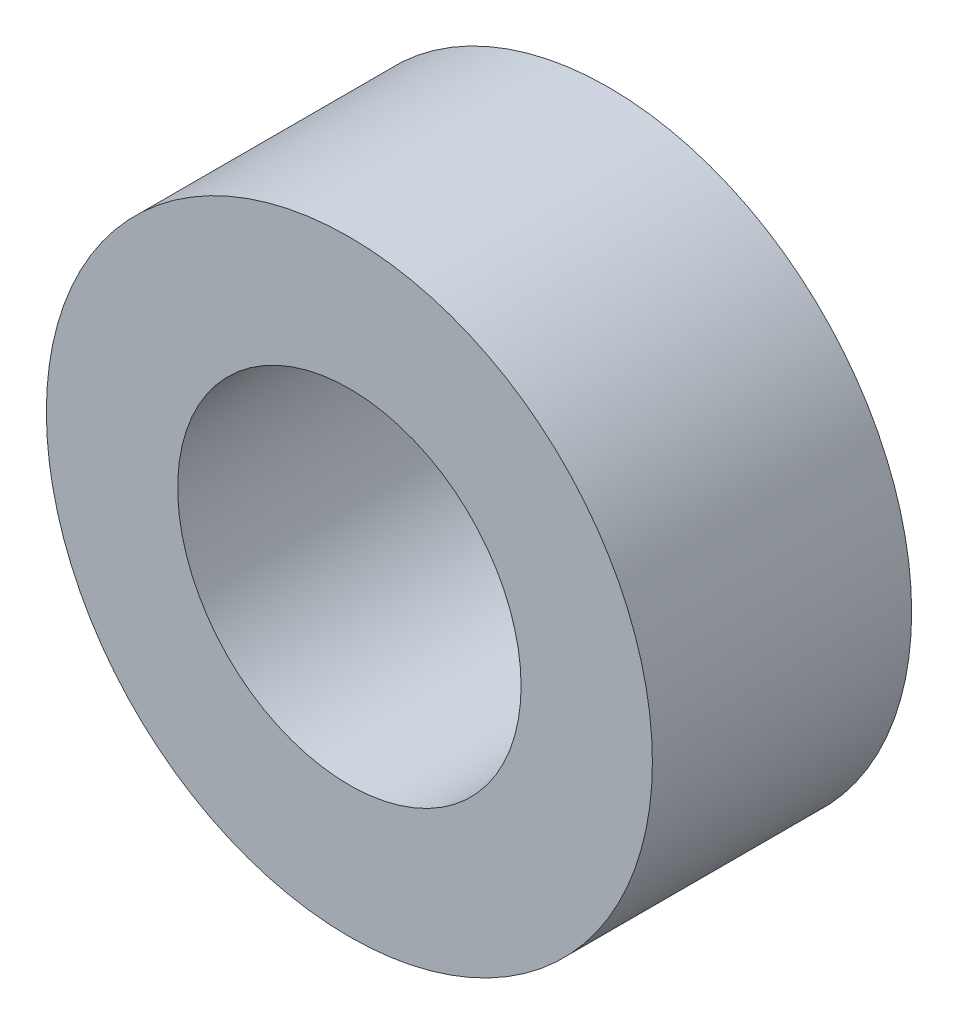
ISO-10303-21;
HEADER;
FILE_DESCRIPTION(('STEP AP214'),'2;1');
FILE_NAME('part.step','',(''),(''),'','','');
FILE_SCHEMA(('AUTOMOTIVE_DESIGN { 1 0 10303 214 1 1 1 1 }'));
ENDSEC;
DATA;
#1=APPLICATION_CONTEXT('core data for automotive mechanical design processes');
#2=APPLICATION_PROTOCOL_DEFINITION('international standard','automotive_design',2000,#1);
#3=PRODUCT_CONTEXT('',#1,'mechanical');
#4=PRODUCT('Part','Part','',(#3));
#5=PRODUCT_RELATED_PRODUCT_CATEGORY('part','',(#4));
#6=PRODUCT_DEFINITION_FORMATION('','',#4);
#7=PRODUCT_DEFINITION_CONTEXT('part definition',#1,'design');
#8=PRODUCT_DEFINITION('design','',#6,#7);
#9=PRODUCT_DEFINITION_SHAPE('','',#8);
#10=(LENGTH_UNIT() NAMED_UNIT(*) SI_UNIT(.MILLI.,.METRE.));
#11=(NAMED_UNIT(*) PLANE_ANGLE_UNIT() SI_UNIT($,.RADIAN.));
#12=(NAMED_UNIT(*) SI_UNIT($,.STERADIAN.) SOLID_ANGLE_UNIT());
#13=UNCERTAINTY_MEASURE_WITH_UNIT(LENGTH_MEASURE(1.E-05),#10,'distance_accuracy_value','');
#14=(GEOMETRIC_REPRESENTATION_CONTEXT(3) GLOBAL_UNCERTAINTY_ASSIGNED_CONTEXT((#13)) GLOBAL_UNIT_ASSIGNED_CONTEXT((#10,
#11,#12)) REPRESENTATION_CONTEXT('',''));
#15=CARTESIAN_POINT('',(0.,0.,0.));
#16=DIRECTION('',(0.,0.,1.));
#17=DIRECTION('',(1.,0.,0.));
#18=AXIS2_PLACEMENT_3D('',#15,#16,#17);
#19=CARTESIAN_POINT('',(0.,0.,77.));
#20=DIRECTION('',(0.,0.,1.));
#21=DIRECTION('',(1.,0.,0.));
#22=AXIS2_PLACEMENT_3D('',#19,#20,#21);
#23=PLANE('',#22);
#24=CARTESIAN_POINT('',(0.,0.,77.));
#25=DIRECTION('',(0.,0.,1.));
#26=DIRECTION('',(1.,0.,0.));
#27=AXIS2_PLACEMENT_3D('',#24,#25,#26);
#28=CIRCLE('',#27,90.);
#29=CARTESIAN_POINT('',(90.,0.,77.));
#30=VERTEX_POINT('',#29);
#31=EDGE_CURVE('E10',#30,#30,#28,.T.);
#32=ORIENTED_EDGE('',*,*,#31,.T.);
#33=EDGE_LOOP('',(#32));
#34=FACE_BOUND('',#33,.T.);
#35=CARTESIAN_POINT('',(0.,0.,77.));
#36=DIRECTION('',(0.,0.,1.));
#37=DIRECTION('',(1.,0.,0.));
#38=AXIS2_PLACEMENT_3D('',#35,#36,#37);
#39=CIRCLE('',#38,51.);
#40=CARTESIAN_POINT('',(51.,0.,77.));
#41=VERTEX_POINT('',#40);
#42=EDGE_CURVE('E42',#41,#41,#39,.T.);
#43=ORIENTED_EDGE('',*,*,#42,.F.);
#44=EDGE_LOOP('',(#43));
#45=FACE_BOUND('',#44,.T.);
#46=ADVANCED_FACE('F31',(#34,#45),#23,.T.);
#47=CARTESIAN_POINT('',(0.,0.,0.));
#48=DIRECTION('',(0.,0.,1.));
#49=DIRECTION('',(1.,0.,0.));
#50=AXIS2_PLACEMENT_3D('',#47,#48,#49);
#51=PLANE('',#50);
#52=CARTESIAN_POINT('',(0.,0.,0.));
#53=DIRECTION('',(0.,0.,1.));
#54=DIRECTION('',(1.,0.,0.));
#55=AXIS2_PLACEMENT_3D('',#52,#53,#54);
#56=CIRCLE('',#55,90.);
#57=CARTESIAN_POINT('',(90.,0.,0.));
#58=VERTEX_POINT('',#57);
#59=EDGE_CURVE('E35',#58,#58,#56,.T.);
#60=ORIENTED_EDGE('',*,*,#59,.F.);
#61=EDGE_LOOP('',(#60));
#62=FACE_BOUND('',#61,.T.);
#63=CARTESIAN_POINT('',(0.,0.,0.));
#64=DIRECTION('',(0.,0.,1.));
#65=DIRECTION('',(1.,0.,0.));
#66=AXIS2_PLACEMENT_3D('',#63,#64,#65);
#67=CIRCLE('',#66,51.);
#68=CARTESIAN_POINT('',(51.,0.,0.));
#69=VERTEX_POINT('',#68);
#70=EDGE_CURVE('E44',#69,#69,#67,.T.);
#71=ORIENTED_EDGE('',*,*,#70,.T.);
#72=EDGE_LOOP('',(#71));
#73=FACE_BOUND('',#72,.T.);
#74=ADVANCED_FACE('F54',(#62,#73),#51,.F.);
#75=CARTESIAN_POINT('',(0.,0.,77.));
#76=DIRECTION('',(0.,0.,-1.));
#77=DIRECTION('',(-1.,0.,0.));
#78=AXIS2_PLACEMENT_3D('',#75,#76,#77);
#79=CYLINDRICAL_SURFACE('',#78,90.);
#80=ORIENTED_EDGE('',*,*,#31,.F.);
#81=EDGE_LOOP('',(#80));
#82=FACE_BOUND('',#81,.T.);
#83=ORIENTED_EDGE('',*,*,#59,.T.);
#84=EDGE_LOOP('',(#83));
#85=FACE_BOUND('',#84,.T.);
#86=ADVANCED_FACE('F33',(#82,#85),#79,.T.);
#87=CARTESIAN_POINT('',(0.,0.,77.));
#88=DIRECTION('',(0.,0.,-1.));
#89=DIRECTION('',(-1.,0.,0.));
#90=AXIS2_PLACEMENT_3D('',#87,#88,#89);
#91=CYLINDRICAL_SURFACE('',#90,51.);
#92=ORIENTED_EDGE('',*,*,#42,.T.);
#93=EDGE_LOOP('',(#92));
#94=FACE_BOUND('',#93,.T.);
#95=ORIENTED_EDGE('',*,*,#70,.F.);
#96=EDGE_LOOP('',(#95));
#97=FACE_BOUND('',#96,.T.);
#98=ADVANCED_FACE('F50',(#94,#97),#91,.F.);
#99=CLOSED_SHELL('',(#46,#74,#86,#98));
#100=MANIFOLD_SOLID_BREP('B2',#99);
#101=ADVANCED_BREP_SHAPE_REPRESENTATION('',(#18,#100),#14);
#102=SHAPE_DEFINITION_REPRESENTATION(#9,#101);
ENDSEC;
END-ISO-10303-21;
